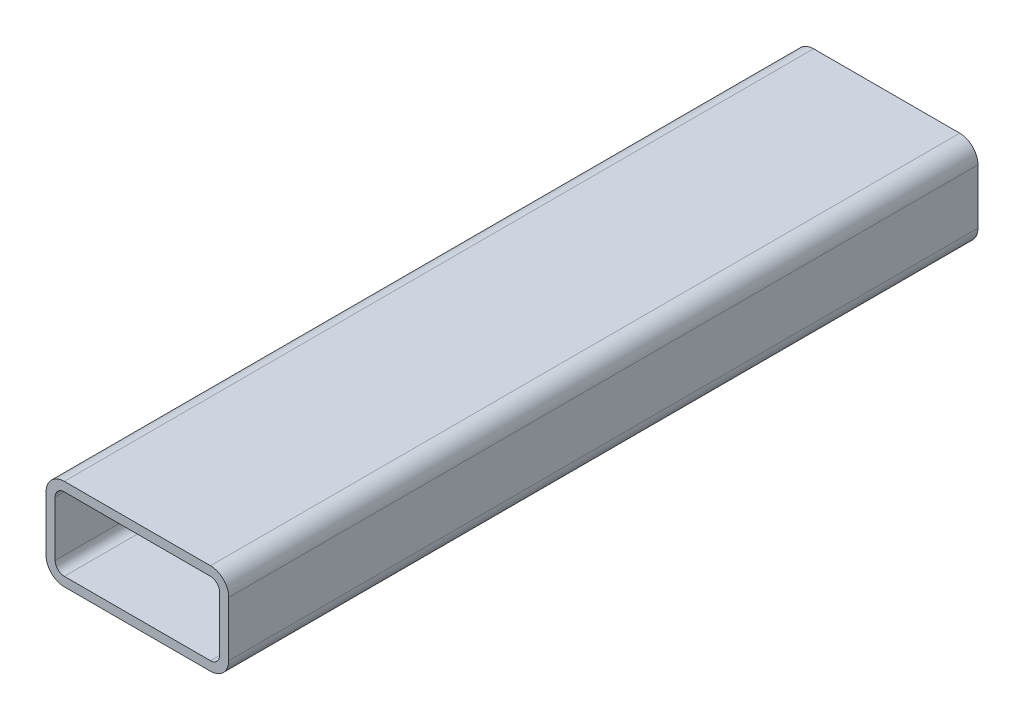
from build123d import *

# Parameters (mm, degrees)
EXTRUSION1_DEPTH = 246


with BuildPart() as part:
    # Esquisse1 → Extrusion1 (new, symmetric)
    with BuildSketch(Plane.XY):
        with BuildLine():
            Line((12, 0), (108, 0))
            ThreePointArc((108, 0), (116.485281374, 3.514718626), (120, 12))
            Line((120, 12), (120, 48))
            ThreePointArc((120, 48), (116.485281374, 56.485281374), (108, 60))
            Line((108, 60), (12, 60))
            ThreePointArc((12, 60), (3.514718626, 56.485281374), (0, 48))
            Line((0, 48), (0, 12))
            ThreePointArc((0, 12), (3.514718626, 3.514718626), (12, 0))
        make_face()
        with BuildLine():
            Line((12, 6), (108, 6))
            ThreePointArc((108, 6), (112.242640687, 7.757359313), (114, 12))
            Line((114, 12), (114, 48))
            ThreePointArc((114, 48), (112.242640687, 52.242640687), (108, 54))
            Line((108, 54), (12, 54))
            ThreePointArc((12, 54), (7.757359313, 52.242640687), (6, 48))
            Line((6, 48), (6, 12))
            ThreePointArc((6, 12), (7.757359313, 7.757359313), (12, 6))
        make_face(mode=Mode.SUBTRACT)
    extrude(amount=EXTRUSION1_DEPTH, both=True)


solid = part.part
